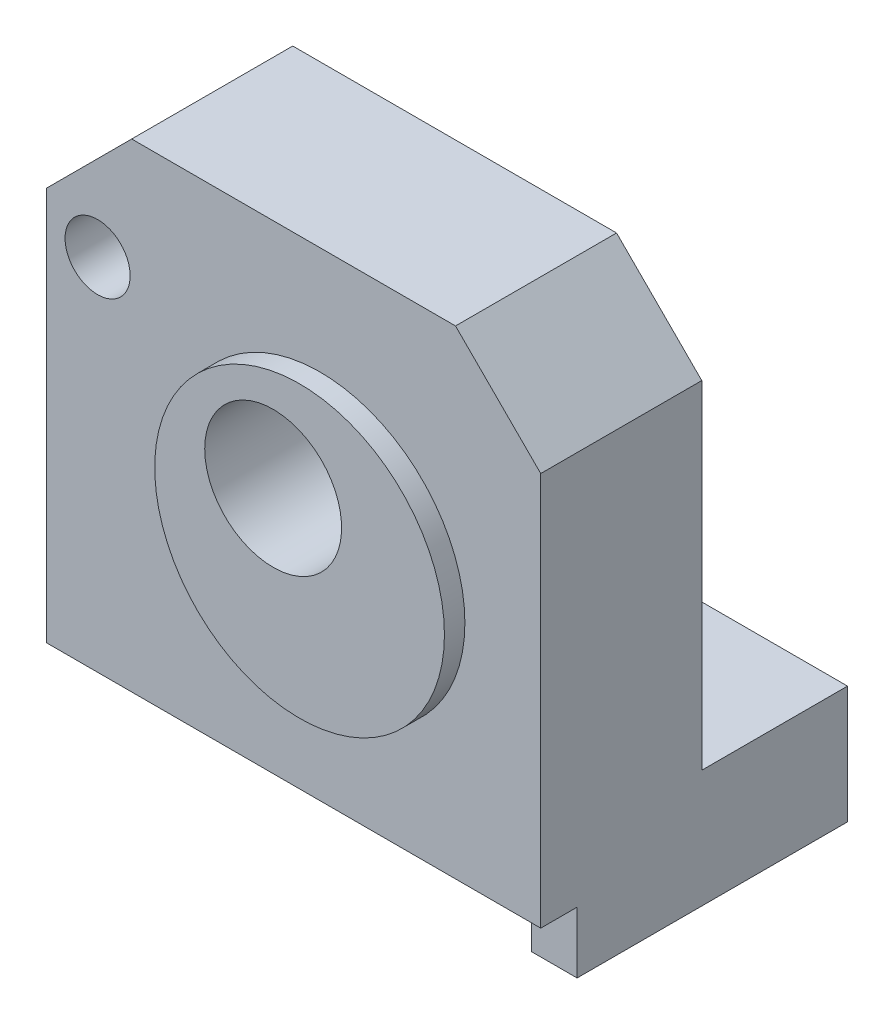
from build123d import *

# Parameters (mm, degrees)
SKETCH1_W               = 36.83
SKETCH1_H               = 39.878
EXTRUDE1_DEPTH          = 12
SKETCH7_R               = 2.4257
CUT_EXTRUDE1_DEPTH      = 32.439110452
SKETCH8_R               = 10.795
EXTRUDE3_DEPTH          = 13.524
SKETCH12_R              = 4.3688
CUT_EXTRUDE3_DEPTH      = 33.051774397
SKETCH13_W              = 36.83
SKETCH13_H              = 6.731
EXTRUDE4_DEPTH          = 22.86
SKETCH15_W              = 3.415000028
SKETCH15_H              = 22.86
EXTRUDE5_DEPTH          = 2.032
SKETCH18_R              = 1.5494
CUT_EXTRUDE7_DEPTH      = 48.733205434
SKETCH23_W              = 36.83
SKETCH23_H              = 12
CUT_EXTRUDE10_DEPTH     = 1.651
CHAMFER2_SIZE           = 6.35
SKETCH19_W              = 22.86
SKETCH19_H              = 2.032
CUT_EXTRUDE8_DEPTH      = 44.591856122
M12X1_00_SPECIAL_D      = 10.2
CUT_EXTRUDE9_DEPTH      = 34.508206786
CUT_EXTRUDE9_DEPTH_BACK = 34.508206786
SKETCH22_W              = 2.71018
SKETCH22_H              = 4.572


with BuildPart() as part:
    # Sketch1 → Extrude1 (new body)
    with BuildSketch(Plane.XY):
        with Locations((0, -2.54)):
            Rectangle(SKETCH1_W, SKETCH1_H)
    extrude(amount=EXTRUDE1_DEPTH)

    # Sketch7 → Cut-Extrude1 (cut, through all)
    with BuildSketch(Plane(origin=(0, 0, 0), x_dir=(-1, 0, 0), z_dir=(0, 0, -1))):
        with Locations((14.605, 6.858)):
            Circle(SKETCH7_R)
    extrude(amount=-CUT_EXTRUDE1_DEPTH, mode=Mode.SUBTRACT)

    # Sketch8 → Extrude3 (add)
    with BuildSketch(Plane(origin=(0, 0, 0), x_dir=(-1, 0, 0), z_dir=(0, 0, -1))):
        with Locations(Location((-1.9685, -3.064398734, 0), (0, 0, 180))):
            Circle(SKETCH8_R)
    extrude(amount=-EXTRUDE3_DEPTH)

    # Sketch12 → Cut-Extrude3 (cut, through all)
    with BuildSketch(Plane.XY.offset(13.524)):
        Circle(SKETCH12_R)
    extrude(amount=-CUT_EXTRUDE3_DEPTH, mode=Mode.SUBTRACT)

    # Sketch13 → Extrude4 (add)
    with BuildSketch(Plane.XY.offset(12)):
        with Locations((0, -19.1135)):
            Rectangle(SKETCH13_W, SKETCH13_H)
    extrude(amount=-EXTRUDE4_DEPTH)

    # Sketch15 → Extrude5 (add)
    with BuildSketch(Plane.XZ.offset(22.479)):
        with Locations((16.707499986, 0.57)):
            Rectangle(SKETCH15_W, SKETCH15_H)
        with Locations((-16.707499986, 0.57)):
            Rectangle(SKETCH15_W, SKETCH15_H)
    extrude(amount=EXTRUDE5_DEPTH)

    # Sketch18 → Cut-Extrude7 (cut, through all)
    with BuildSketch(Plane.XZ.offset(24.511)):
        with Locations(Location((-10.500000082, -3.960000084, 0), (0, 0, 180))):
            Circle(SKETCH18_R)
    cut_extrude7 = extrude(amount=-CUT_EXTRUDE7_DEPTH, mode=Mode.SUBTRACT)

    # Mirror2: Cut-Extrude7 across plane
    add(cut_extrude7.mirror(Plane(origin=(0, 0, 0), x_dir=(0, 0, 1), z_dir=(1, 0, 0))), mode=Mode.SUBTRACT)

    # Sketch23 → Cut-Extrude10 (cut)
    with BuildSketch(Plane(origin=(0, 17.399, 0), x_dir=(-1, 0, 0), z_dir=(0, 1, 0))):
        with Locations((0, 6)):
            Rectangle(SKETCH23_W, SKETCH23_H)
    extrude(amount=-CUT_EXTRUDE10_DEPTH, mode=Mode.SUBTRACT)

    # Chamfer2
    chamfer2_edges = [part.edges().sort_by_distance(p)[0] for p in [
        (18.415, 15.748, 6),
        (-18.415, 15.748, 6),
    ]]
    chamfer(chamfer2_edges, length=CHAMFER2_SIZE)

    # Sketch19 → Cut-Extrude8 (cut, through all)
    with BuildSketch(Plane(origin=(-14.999999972, 0, 0), x_dir=(0, 0, -1), z_dir=(1, 0, 0))):
        with Locations((-0.57, -23.495)):
            Rectangle(SKETCH19_W, SKETCH19_H)
    extrude(amount=-CUT_EXTRUDE8_DEPTH, mode=Mode.SUBTRACT)

    # M12x1.00 SPECIAL (through all)
    with Locations(Plane(origin=(0, 0, 0), x_dir=(-1, 0, 0), z_dir=(0, 0, -1))):
        with Locations((0, 0)):
            Hole(M12X1_00_SPECIAL_D / 2)

    # Sketch22 → Cut-Extrude9 (cut, two sides: drawn at the far end of the back side and taken through both)
    with BuildSketch(Plane(origin=(0, 0, 0), x_dir=(0, 0, -1), z_dir=(1, 0, 0)).offset(-CUT_EXTRUDE9_DEPTH_BACK)):
        with Locations((-10.64491, -22.225)):
            Rectangle(SKETCH22_W, SKETCH22_H)
    extrude(amount=CUT_EXTRUDE9_DEPTH + CUT_EXTRUDE9_DEPTH_BACK, mode=Mode.SUBTRACT)


solid = part.part
